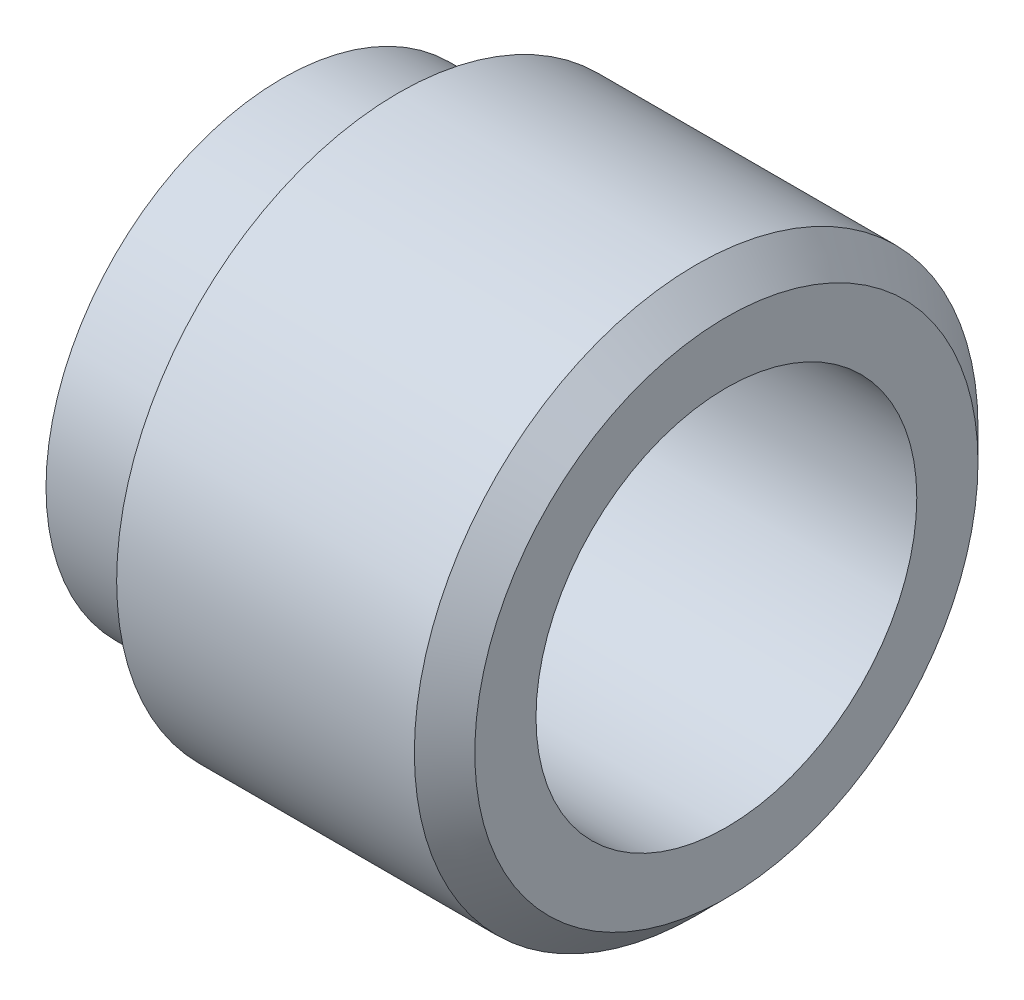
ISO-10303-21;
HEADER;
FILE_DESCRIPTION(('STEP AP214'),'2;1');
FILE_NAME('part.step','',(''),(''),'','','');
FILE_SCHEMA(('AUTOMOTIVE_DESIGN { 1 0 10303 214 1 1 1 1 }'));
ENDSEC;
DATA;
#1=APPLICATION_CONTEXT('core data for automotive mechanical design processes');
#2=APPLICATION_PROTOCOL_DEFINITION('international standard','automotive_design',2000,#1);
#3=PRODUCT_CONTEXT('',#1,'mechanical');
#4=PRODUCT('Part','Part','',(#3));
#5=PRODUCT_RELATED_PRODUCT_CATEGORY('part','',(#4));
#6=PRODUCT_DEFINITION_FORMATION('','',#4);
#7=PRODUCT_DEFINITION_CONTEXT('part definition',#1,'design');
#8=PRODUCT_DEFINITION('design','',#6,#7);
#9=PRODUCT_DEFINITION_SHAPE('','',#8);
#10=(LENGTH_UNIT() NAMED_UNIT(*) SI_UNIT(.MILLI.,.METRE.));
#11=(NAMED_UNIT(*) PLANE_ANGLE_UNIT() SI_UNIT($,.RADIAN.));
#12=(NAMED_UNIT(*) SI_UNIT($,.STERADIAN.) SOLID_ANGLE_UNIT());
#13=UNCERTAINTY_MEASURE_WITH_UNIT(LENGTH_MEASURE(1.E-05),#10,'distance_accuracy_value','');
#14=(GEOMETRIC_REPRESENTATION_CONTEXT(3) GLOBAL_UNCERTAINTY_ASSIGNED_CONTEXT((#13)) GLOBAL_UNIT_ASSIGNED_CONTEXT((#10,
#11,#12)) REPRESENTATION_CONTEXT('',''));
#15=CARTESIAN_POINT('',(0.,0.,0.));
#16=DIRECTION('',(0.,0.,1.));
#17=DIRECTION('',(1.,0.,0.));
#18=AXIS2_PLACEMENT_3D('',#15,#16,#17);
#19=CARTESIAN_POINT('',(0.,0.,0.));
#20=DIRECTION('',(1.,0.,0.));
#21=DIRECTION('',(0.,0.,-1.));
#22=AXIS2_PLACEMENT_3D('',#19,#20,#21);
#23=PLANE('',#22);
#24=CARTESIAN_POINT('',(0.,0.,0.));
#25=DIRECTION('',(1.,0.,0.));
#26=DIRECTION('',(0.,0.,-1.));
#27=AXIS2_PLACEMENT_3D('',#24,#25,#26);
#28=CIRCLE('',#27,4.7371);
#29=CARTESIAN_POINT('',(0.,0.,-4.7371));
#30=VERTEX_POINT('',#29);
#31=EDGE_CURVE('E48',#30,#30,#28,.T.);
#32=ORIENTED_EDGE('',*,*,#31,.F.);
#33=EDGE_LOOP('',(#32));
#34=FACE_BOUND('',#33,.T.);
#35=CARTESIAN_POINT('',(0.,0.,0.));
#36=DIRECTION('',(1.,0.,0.));
#37=DIRECTION('',(0.,0.,-1.));
#38=AXIS2_PLACEMENT_3D('',#35,#36,#37);
#39=CIRCLE('',#38,3.96875);
#40=CARTESIAN_POINT('',(0.,0.,-3.96875));
#41=VERTEX_POINT('',#40);
#42=EDGE_CURVE('E10',#41,#41,#39,.F.);
#43=ORIENTED_EDGE('',*,*,#42,.F.);
#44=EDGE_LOOP('',(#43));
#45=FACE_BOUND('',#44,.T.);
#46=ADVANCED_FACE('F33',(#34,#45),#23,.F.);
#47=CARTESIAN_POINT('',(5.5118,0.,0.));
#48=DIRECTION('',(1.,0.,0.));
#49=DIRECTION('',(0.,0.,-1.));
#50=AXIS2_PLACEMENT_3D('',#47,#48,#49);
#51=PLANE('',#50);
#52=CARTESIAN_POINT('',(5.5118,0.,0.));
#53=DIRECTION('',(1.,0.,0.));
#54=DIRECTION('',(0.,0.,-1.));
#55=AXIS2_PLACEMENT_3D('',#52,#53,#54);
#56=CIRCLE('',#55,4.2291);
#57=CARTESIAN_POINT('',(5.5118,0.,-4.2291));
#58=VERTEX_POINT('',#57);
#59=EDGE_CURVE('E44',#58,#58,#56,.T.);
#60=ORIENTED_EDGE('',*,*,#59,.T.);
#61=EDGE_LOOP('',(#60));
#62=FACE_BOUND('',#61,.T.);
#63=CARTESIAN_POINT('',(5.5118,0.,0.));
#64=DIRECTION('',(1.,0.,0.));
#65=DIRECTION('',(0.,0.,-1.));
#66=AXIS2_PLACEMENT_3D('',#63,#64,#65);
#67=CIRCLE('',#66,3.2004);
#68=CARTESIAN_POINT('',(5.5118,0.,-3.2004));
#69=VERTEX_POINT('',#68);
#70=EDGE_CURVE('E53',#69,#69,#67,.T.);
#71=ORIENTED_EDGE('',*,*,#70,.F.);
#72=EDGE_LOOP('',(#71));
#73=FACE_BOUND('',#72,.T.);
#74=ADVANCED_FACE('F78',(#62,#73),#51,.T.);
#75=CARTESIAN_POINT('',(5.5118,0.,0.));
#76=DIRECTION('',(-1.,0.,0.));
#77=DIRECTION('',(0.,0.,1.));
#78=AXIS2_PLACEMENT_3D('',#75,#76,#77);
#79=CYLINDRICAL_SURFACE('',#78,4.7371);
#80=CARTESIAN_POINT('',(5.0038,0.,0.));
#81=DIRECTION('',(1.,0.,0.));
#82=DIRECTION('',(0.,0.,-1.));
#83=AXIS2_PLACEMENT_3D('',#80,#81,#82);
#84=CIRCLE('',#83,4.7371);
#85=CARTESIAN_POINT('',(5.0038,0.,-4.7371));
#86=VERTEX_POINT('',#85);
#87=EDGE_CURVE('E40',#86,#86,#84,.F.);
#88=ORIENTED_EDGE('',*,*,#87,.T.);
#89=EDGE_LOOP('',(#88));
#90=FACE_BOUND('',#89,.T.);
#91=ORIENTED_EDGE('',*,*,#31,.T.);
#92=EDGE_LOOP('',(#91));
#93=FACE_BOUND('',#92,.T.);
#94=ADVANCED_FACE('F84',(#90,#93),#79,.T.);
#95=CARTESIAN_POINT('',(5.5118,0.,0.));
#96=DIRECTION('',(-1.,0.,0.));
#97=DIRECTION('',(0.,0.,1.));
#98=AXIS2_PLACEMENT_3D('',#95,#96,#97);
#99=CYLINDRICAL_SURFACE('',#98,3.2004);
#100=ORIENTED_EDGE('',*,*,#70,.T.);
#101=EDGE_LOOP('',(#100));
#102=FACE_BOUND('',#101,.T.);
#103=CARTESIAN_POINT('',(-1.9558,0.,0.));
#104=DIRECTION('',(-1.,0.,0.));
#105=DIRECTION('',(0.,0.,1.));
#106=AXIS2_PLACEMENT_3D('',#103,#104,#105);
#107=CIRCLE('',#106,3.2004);
#108=CARTESIAN_POINT('',(-1.9558,0.,3.2004));
#109=VERTEX_POINT('',#108);
#110=EDGE_CURVE('E59',#109,#109,#107,.T.);
#111=ORIENTED_EDGE('',*,*,#110,.T.);
#112=EDGE_LOOP('',(#111));
#113=FACE_BOUND('',#112,.T.);
#114=ADVANCED_FACE('F63',(#102,#113),#99,.F.);
#115=CARTESIAN_POINT('',(5.5118,0.,0.));
#116=DIRECTION('',(-1.,0.,0.));
#117=DIRECTION('',(0.,0.,1.));
#118=AXIS2_PLACEMENT_3D('',#115,#116,#117);
#119=CONICAL_SURFACE('',#118,4.2291,0.785398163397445);
#120=ORIENTED_EDGE('',*,*,#87,.F.);
#121=EDGE_LOOP('',(#120));
#122=FACE_BOUND('',#121,.T.);
#123=ORIENTED_EDGE('',*,*,#59,.F.);
#124=EDGE_LOOP('',(#123));
#125=FACE_BOUND('',#124,.T.);
#126=ADVANCED_FACE('F35',(#122,#125),#119,.T.);
#127=CARTESIAN_POINT('',(-1.9558,0.,0.));
#128=DIRECTION('',(-1.,0.,0.));
#129=DIRECTION('',(0.,0.,1.));
#130=AXIS2_PLACEMENT_3D('',#127,#128,#129);
#131=PLANE('',#130);
#132=CARTESIAN_POINT('',(-1.9558,0.,0.));
#133=DIRECTION('',(-1.,0.,0.));
#134=DIRECTION('',(0.,0.,1.));
#135=AXIS2_PLACEMENT_3D('',#132,#133,#134);
#136=CIRCLE('',#135,3.96875);
#137=CARTESIAN_POINT('',(-1.9558,0.,3.96875));
#138=VERTEX_POINT('',#137);
#139=EDGE_CURVE('E56',#138,#138,#136,.T.);
#140=ORIENTED_EDGE('',*,*,#139,.T.);
#141=EDGE_LOOP('',(#140));
#142=FACE_BOUND('',#141,.T.);
#143=ORIENTED_EDGE('',*,*,#110,.F.);
#144=EDGE_LOOP('',(#143));
#145=FACE_BOUND('',#144,.T.);
#146=ADVANCED_FACE('F65',(#142,#145),#131,.T.);
#147=CARTESIAN_POINT('',(-1.9558,0.,0.));
#148=DIRECTION('',(1.,0.,0.));
#149=DIRECTION('',(0.,0.,-1.));
#150=AXIS2_PLACEMENT_3D('',#147,#148,#149);
#151=CYLINDRICAL_SURFACE('',#150,3.96875);
#152=ORIENTED_EDGE('',*,*,#139,.F.);
#153=EDGE_LOOP('',(#152));
#154=FACE_BOUND('',#153,.T.);
#155=ORIENTED_EDGE('',*,*,#42,.T.);
#156=EDGE_LOOP('',(#155));
#157=FACE_BOUND('',#156,.T.);
#158=ADVANCED_FACE('F67',(#154,#157),#151,.T.);
#159=CLOSED_SHELL('',(#46,#74,#94,#114,#126,#146,#158));
#160=MANIFOLD_SOLID_BREP('B2',#159);
#161=ADVANCED_BREP_SHAPE_REPRESENTATION('',(#18,#160),#14);
#162=SHAPE_DEFINITION_REPRESENTATION(#9,#161);
ENDSEC;
END-ISO-10303-21;
